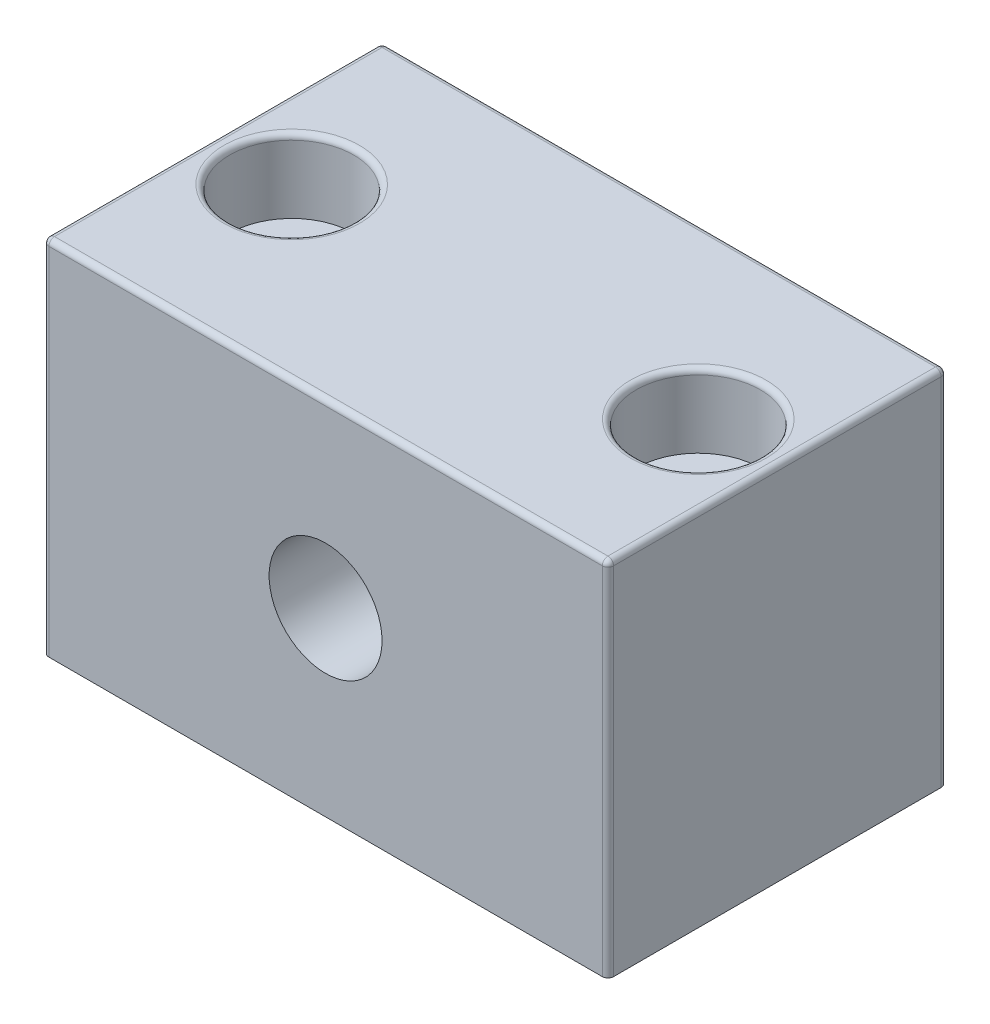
from build123d import *

# Parameters (mm, degrees)
BOSS_EXTRUDE1_DEPTH      = 15
BOSS_EXTRUDE1_DEPTH_BACK = 15
SKETCH1_W                = 50
SKETCH1_H                = 32
SKETCH2_R                = 5
CUT_EXTRUDE1_DEPTH       = 67.513156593
SKETCH3_R                = 5.5
CUT_EXTRUDE2_DEPTH       = 6.5
SKETCH4_R                = 3.3
CUT_EXTRUDE3_DEPTH       = 59.096901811
FILLET1_R                = 0.5


with BuildPart() as part:
    # Sketch1 → Boss-Extrude1 (new, two sides: drawn at the far end of the back side and taken through both)
    with BuildSketch(Plane.XY.offset(-BOSS_EXTRUDE1_DEPTH_BACK)):
        with Locations((25, 16)):
            Rectangle(SKETCH1_W, SKETCH1_H)
    extrude(amount=BOSS_EXTRUDE1_DEPTH + BOSS_EXTRUDE1_DEPTH_BACK)

    # Sketch2 → Cut-Extrude1 (cut, through all)
    with BuildSketch(Plane.XY.offset(15)):
        with Locations((25, 16)):
            Circle(SKETCH2_R)
    extrude(amount=-CUT_EXTRUDE1_DEPTH, mode=Mode.SUBTRACT)

    # Sketch3 → Cut-Extrude2 (cut)
    with BuildSketch(Plane(origin=(0, 32, 0), x_dir=(1, 0, 0), z_dir=(0, 1, 0))):
        with Locations(Location((43, 0, 0), (0, 0, 270))):
            Circle(SKETCH3_R)
    cut_extrude2 = extrude(amount=-CUT_EXTRUDE2_DEPTH, mode=Mode.SUBTRACT)

    # Sketch4 → Cut-Extrude3 (cut, through all)
    with BuildSketch(Plane(origin=(0, 25.5, 0), x_dir=(1, 0, 0), z_dir=(0, 1, 0))):
        with Locations(Location((43, 0, 0), (0, 0, 270))):
            Circle(SKETCH4_R)
    cut_extrude3 = extrude(amount=-CUT_EXTRUDE3_DEPTH, mode=Mode.SUBTRACT)

    # Mirror1: Cut-Extrude2, Cut-Extrude3 across plane
    add(cut_extrude2.mirror(Plane(origin=(25.000000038, 0, 0), x_dir=(0, 0, 1), z_dir=(1, 0, 0))), mode=Mode.SUBTRACT)
    add(cut_extrude3.mirror(Plane(origin=(25.000000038, 0, 0), x_dir=(0, 0, 1), z_dir=(1, 0, 0))), mode=Mode.SUBTRACT)

    # Fillet1
    fillet1_edges = [part.edges().sort_by_distance(p)[0] for p in [
        (50, 16, -15),
        (0, 16, 15),
        (25, 32, -15),
        (50, 16, 15),
        (25, 32, 15),
        (43, 32, -5.5),
        (7.000000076, 32, -5.5),
        (0, 16, -15),
        (0, 32, 0),
        (50, 32, 0),
    ]]
    fillet(fillet1_edges, radius=FILLET1_R)


solid = part.part
